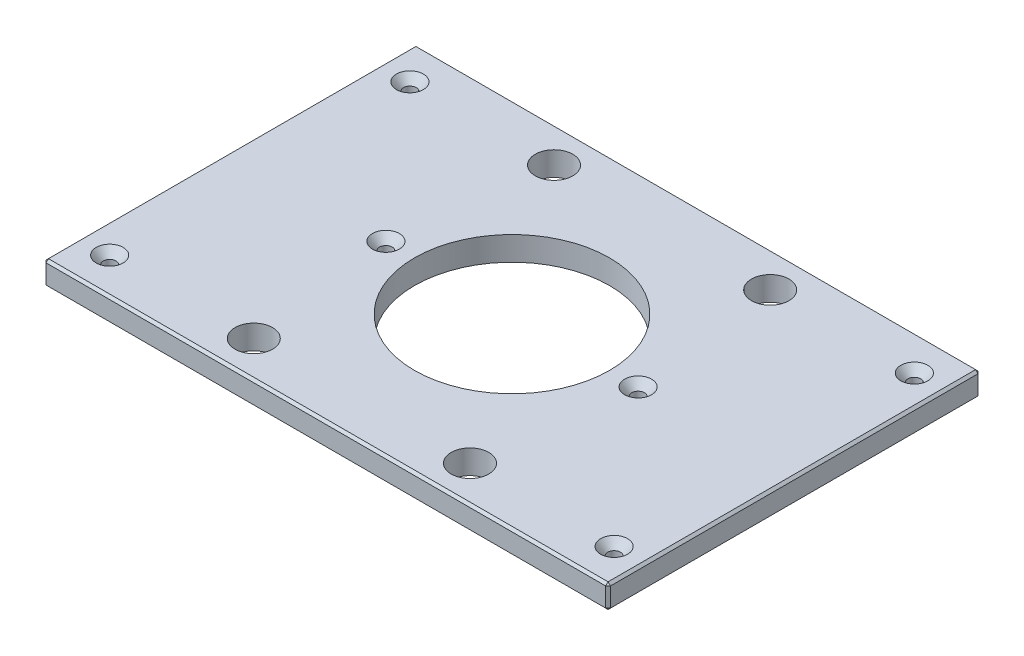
ISO-10303-21;
HEADER;
FILE_DESCRIPTION(('STEP AP214'),'2;1');
FILE_NAME('part.step','',(''),(''),'','','');
FILE_SCHEMA(('AUTOMOTIVE_DESIGN { 1 0 10303 214 1 1 1 1 }'));
ENDSEC;
DATA;
#1=APPLICATION_CONTEXT('core data for automotive mechanical design processes');
#2=APPLICATION_PROTOCOL_DEFINITION('international standard','automotive_design',2000,#1);
#3=PRODUCT_CONTEXT('',#1,'mechanical');
#4=PRODUCT('Part','Part','',(#3));
#5=PRODUCT_RELATED_PRODUCT_CATEGORY('part','',(#4));
#6=PRODUCT_DEFINITION_FORMATION('','',#4);
#7=PRODUCT_DEFINITION_CONTEXT('part definition',#1,'design');
#8=PRODUCT_DEFINITION('design','',#6,#7);
#9=PRODUCT_DEFINITION_SHAPE('','',#8);
#10=(LENGTH_UNIT() NAMED_UNIT(*) SI_UNIT(.MILLI.,.METRE.));
#11=(NAMED_UNIT(*) PLANE_ANGLE_UNIT() SI_UNIT($,.RADIAN.));
#12=(NAMED_UNIT(*) SI_UNIT($,.STERADIAN.) SOLID_ANGLE_UNIT());
#13=UNCERTAINTY_MEASURE_WITH_UNIT(LENGTH_MEASURE(1.E-05),#10,'distance_accuracy_value','');
#14=(GEOMETRIC_REPRESENTATION_CONTEXT(3) GLOBAL_UNCERTAINTY_ASSIGNED_CONTEXT((#13)) GLOBAL_UNIT_ASSIGNED_CONTEXT((#10,
#11,#12)) REPRESENTATION_CONTEXT('',''));
#15=CARTESIAN_POINT('',(0.,0.,0.));
#16=DIRECTION('',(0.,0.,1.));
#17=DIRECTION('',(1.,0.,0.));
#18=AXIS2_PLACEMENT_3D('',#15,#16,#17);
#19=CARTESIAN_POINT('',(-149.225,12.7,-98.425));
#20=DIRECTION('',(1.,0.,0.));
#21=DIRECTION('',(0.,0.,-1.));
#22=AXIS2_PLACEMENT_3D('',#19,#20,#21);
#23=PLANE('',#22);
#24=DIRECTION('',(0.,0.,-1.));
#25=VECTOR('',#24,1.);
#26=CARTESIAN_POINT('',(-149.225,11.4300000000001,-98.425));
#27=LINE('',#26,#25);
#28=CARTESIAN_POINT('',(-149.225,11.4300000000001,97.1550000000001));
#29=VERTEX_POINT('',#28);
#30=CARTESIAN_POINT('',(-149.225,11.4300000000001,-97.1550000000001));
#31=VERTEX_POINT('',#30);
#32=EDGE_CURVE('E134',#29,#31,#27,.T.);
#33=ORIENTED_EDGE('',*,*,#32,.T.);
#34=DIRECTION('',(0.,-1.,0.));
#35=VECTOR('',#34,1.);
#36=CARTESIAN_POINT('',(-149.225,12.7,-97.1550000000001));
#37=LINE('',#36,#35);
#38=CARTESIAN_POINT('',(-149.225,1.26999999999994,-97.1550000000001));
#39=VERTEX_POINT('',#38);
#40=EDGE_CURVE('E130',#31,#39,#37,.T.);
#41=ORIENTED_EDGE('',*,*,#40,.T.);
#42=DIRECTION('',(0.,0.,1.));
#43=VECTOR('',#42,1.);
#44=CARTESIAN_POINT('',(-149.225,1.26999999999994,-98.425));
#45=LINE('',#44,#43);
#46=CARTESIAN_POINT('',(-149.225,1.26999999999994,97.1550000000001));
#47=VERTEX_POINT('',#46);
#48=EDGE_CURVE('E125',#39,#47,#45,.T.);
#49=ORIENTED_EDGE('',*,*,#48,.T.);
#50=DIRECTION('',(0.,1.,0.));
#51=VECTOR('',#50,1.);
#52=CARTESIAN_POINT('',(-149.225,12.7,97.1550000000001));
#53=LINE('',#52,#51);
#54=EDGE_CURVE('E127',#47,#29,#53,.T.);
#55=ORIENTED_EDGE('',*,*,#54,.T.);
#56=EDGE_LOOP('',(#33,#41,#49,#55));
#57=FACE_BOUND('',#56,.T.);
#58=ADVANCED_FACE('F34',(#57),#23,.F.);
#59=CARTESIAN_POINT('',(-149.225,12.7,98.425));
#60=DIRECTION('',(0.,0.,-1.));
#61=DIRECTION('',(-1.,0.,0.));
#62=AXIS2_PLACEMENT_3D('',#59,#60,#61);
#63=PLANE('',#62);
#64=DIRECTION('',(1.,0.,0.));
#65=VECTOR('',#64,1.);
#66=CARTESIAN_POINT('',(-149.225,1.26999999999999,98.425));
#67=LINE('',#66,#65);
#68=CARTESIAN_POINT('',(-147.955,1.26999999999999,98.425));
#69=VERTEX_POINT('',#68);
#70=CARTESIAN_POINT('',(147.955,1.26999999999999,98.425));
#71=VERTEX_POINT('',#70);
#72=EDGE_CURVE('E57',#69,#71,#67,.T.);
#73=ORIENTED_EDGE('',*,*,#72,.T.);
#74=DIRECTION('',(0.,1.,0.));
#75=VECTOR('',#74,1.);
#76=CARTESIAN_POINT('',(147.955,12.7,98.425));
#77=LINE('',#76,#75);
#78=CARTESIAN_POINT('',(147.955,11.43,98.425));
#79=VERTEX_POINT('',#78);
#80=EDGE_CURVE('E11',#71,#79,#77,.T.);
#81=ORIENTED_EDGE('',*,*,#80,.T.);
#82=DIRECTION('',(-1.,0.,0.));
#83=VECTOR('',#82,1.);
#84=CARTESIAN_POINT('',(-149.225,11.43,98.425));
#85=LINE('',#84,#83);
#86=CARTESIAN_POINT('',(-147.955,11.43,98.425));
#87=VERTEX_POINT('',#86);
#88=EDGE_CURVE('E43',#79,#87,#85,.T.);
#89=ORIENTED_EDGE('',*,*,#88,.T.);
#90=DIRECTION('',(0.,-1.,0.));
#91=VECTOR('',#90,1.);
#92=CARTESIAN_POINT('',(-147.955,12.7,98.425));
#93=LINE('',#92,#91);
#94=EDGE_CURVE('E278',#87,#69,#93,.T.);
#95=ORIENTED_EDGE('',*,*,#94,.T.);
#96=EDGE_LOOP('',(#73,#81,#89,#95));
#97=FACE_BOUND('',#96,.T.);
#98=ADVANCED_FACE('F347',(#97),#63,.F.);
#99=CARTESIAN_POINT('',(149.225,12.7,-98.425));
#100=DIRECTION('',(-1.,0.,0.));
#101=DIRECTION('',(0.,0.,1.));
#102=AXIS2_PLACEMENT_3D('',#99,#100,#101);
#103=PLANE('',#102);
#104=DIRECTION('',(0.,0.,-1.));
#105=VECTOR('',#104,1.);
#106=CARTESIAN_POINT('',(149.225,1.26999999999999,-98.425));
#107=LINE('',#106,#105);
#108=CARTESIAN_POINT('',(149.225,1.26999999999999,97.1550000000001));
#109=VERTEX_POINT('',#108);
#110=CARTESIAN_POINT('',(149.225,1.26999999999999,-97.1550000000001));
#111=VERTEX_POINT('',#110);
#112=EDGE_CURVE('E273',#109,#111,#107,.T.);
#113=ORIENTED_EDGE('',*,*,#112,.T.);
#114=DIRECTION('',(0.,1.,0.));
#115=VECTOR('',#114,1.);
#116=CARTESIAN_POINT('',(149.225,12.7,-97.1550000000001));
#117=LINE('',#116,#115);
#118=CARTESIAN_POINT('',(149.225,11.4300000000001,-97.1550000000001));
#119=VERTEX_POINT('',#118);
#120=EDGE_CURVE('E275',#111,#119,#117,.T.);
#121=ORIENTED_EDGE('',*,*,#120,.T.);
#122=DIRECTION('',(0.,0.,1.));
#123=VECTOR('',#122,1.);
#124=CARTESIAN_POINT('',(149.225,11.4300000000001,98.425));
#125=LINE('',#124,#123);
#126=CARTESIAN_POINT('',(149.225,11.4300000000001,97.1550000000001));
#127=VERTEX_POINT('',#126);
#128=EDGE_CURVE('E271',#119,#127,#125,.T.);
#129=ORIENTED_EDGE('',*,*,#128,.T.);
#130=DIRECTION('',(0.,-1.,0.));
#131=VECTOR('',#130,1.);
#132=CARTESIAN_POINT('',(149.225,12.7,97.1550000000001));
#133=LINE('',#132,#131);
#134=EDGE_CURVE('E269',#127,#109,#133,.T.);
#135=ORIENTED_EDGE('',*,*,#134,.T.);
#136=EDGE_LOOP('',(#113,#121,#129,#135));
#137=FACE_BOUND('',#136,.T.);
#138=ADVANCED_FACE('F334',(#137),#103,.F.);
#139=CARTESIAN_POINT('',(-149.225,12.7,-98.425));
#140=DIRECTION('',(0.,0.,1.));
#141=DIRECTION('',(1.,0.,0.));
#142=AXIS2_PLACEMENT_3D('',#139,#140,#141);
#143=PLANE('',#142);
#144=DIRECTION('',(-1.,0.,0.));
#145=VECTOR('',#144,1.);
#146=CARTESIAN_POINT('',(-149.225,1.26999999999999,-98.425));
#147=LINE('',#146,#145);
#148=CARTESIAN_POINT('',(147.955,1.26999999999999,-98.425));
#149=VERTEX_POINT('',#148);
#150=CARTESIAN_POINT('',(-147.955,1.26999999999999,-98.425));
#151=VERTEX_POINT('',#150);
#152=EDGE_CURVE('E245',#149,#151,#147,.T.);
#153=ORIENTED_EDGE('',*,*,#152,.T.);
#154=DIRECTION('',(0.,1.,0.));
#155=VECTOR('',#154,1.);
#156=CARTESIAN_POINT('',(-147.955,12.7,-98.425));
#157=LINE('',#156,#155);
#158=CARTESIAN_POINT('',(-147.955,11.4300000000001,-98.425));
#159=VERTEX_POINT('',#158);
#160=EDGE_CURVE('E249',#151,#159,#157,.T.);
#161=ORIENTED_EDGE('',*,*,#160,.T.);
#162=DIRECTION('',(1.,0.,0.));
#163=VECTOR('',#162,1.);
#164=CARTESIAN_POINT('',(149.225,11.4300000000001,-98.425));
#165=LINE('',#164,#163);
#166=CARTESIAN_POINT('',(147.955,11.4300000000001,-98.425));
#167=VERTEX_POINT('',#166);
#168=EDGE_CURVE('E247',#159,#167,#165,.T.);
#169=ORIENTED_EDGE('',*,*,#168,.T.);
#170=DIRECTION('',(0.,-1.,0.));
#171=VECTOR('',#170,1.);
#172=CARTESIAN_POINT('',(147.955,12.7,-98.425));
#173=LINE('',#172,#171);
#174=EDGE_CURVE('E243',#167,#149,#173,.T.);
#175=ORIENTED_EDGE('',*,*,#174,.T.);
#176=EDGE_LOOP('',(#153,#161,#169,#175));
#177=FACE_BOUND('',#176,.T.);
#178=ADVANCED_FACE('F308',(#177),#143,.F.);
#179=CARTESIAN_POINT('',(0.,12.7,0.));
#180=DIRECTION('',(0.,1.,0.));
#181=DIRECTION('',(0.,0.,1.));
#182=AXIS2_PLACEMENT_3D('',#179,#180,#181);
#183=PLANE('',#182);
#184=CARTESIAN_POINT('',(133.35,12.7,-79.375));
#185=DIRECTION('',(0.,1.,0.));
#186=DIRECTION('',(0.,0.,1.));
#187=AXIS2_PLACEMENT_3D('',#184,#185,#186);
#188=CIRCLE('',#187,7.13739999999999);
#189=CARTESIAN_POINT('',(133.35,12.7,-72.2376));
#190=VERTEX_POINT('',#189);
#191=EDGE_CURVE('E751',#190,#190,#188,.T.);
#192=ORIENTED_EDGE('',*,*,#191,.F.);
#193=EDGE_LOOP('',(#192));
#194=FACE_BOUND('',#193,.T.);
#195=CARTESIAN_POINT('',(133.35,12.7,79.375));
#196=DIRECTION('',(0.,1.,0.));
#197=DIRECTION('',(0.,0.,1.));
#198=AXIS2_PLACEMENT_3D('',#195,#196,#197);
#199=CIRCLE('',#198,7.13739999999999);
#200=CARTESIAN_POINT('',(133.35,12.7,86.5124));
#201=VERTEX_POINT('',#200);
#202=EDGE_CURVE('E755',#201,#201,#199,.T.);
#203=ORIENTED_EDGE('',*,*,#202,.F.);
#204=EDGE_LOOP('',(#203));
#205=FACE_BOUND('',#204,.T.);
#206=CARTESIAN_POINT('',(-133.35,12.7,79.375));
#207=DIRECTION('',(0.,1.,0.));
#208=DIRECTION('',(0.,0.,1.));
#209=AXIS2_PLACEMENT_3D('',#206,#207,#208);
#210=CIRCLE('',#209,7.13739999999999);
#211=CARTESIAN_POINT('',(-133.35,12.7,86.5124));
#212=VERTEX_POINT('',#211);
#213=EDGE_CURVE('E759',#212,#212,#210,.T.);
#214=ORIENTED_EDGE('',*,*,#213,.F.);
#215=EDGE_LOOP('',(#214));
#216=FACE_BOUND('',#215,.T.);
#217=CARTESIAN_POINT('',(-66.675,12.7,0.));
#218=DIRECTION('',(0.,1.,0.));
#219=DIRECTION('',(0.,0.,1.));
#220=AXIS2_PLACEMENT_3D('',#217,#218,#219);
#221=CIRCLE('',#220,7.1374);
#222=CARTESIAN_POINT('',(-66.675,12.7,7.1374));
#223=VERTEX_POINT('',#222);
#224=EDGE_CURVE('E763',#223,#223,#221,.T.);
#225=ORIENTED_EDGE('',*,*,#224,.F.);
#226=EDGE_LOOP('',(#225));
#227=FACE_BOUND('',#226,.T.);
#228=CARTESIAN_POINT('',(66.675,12.7,0.));
#229=DIRECTION('',(0.,1.,0.));
#230=DIRECTION('',(0.,0.,1.));
#231=AXIS2_PLACEMENT_3D('',#228,#229,#230);
#232=CIRCLE('',#231,7.1374);
#233=CARTESIAN_POINT('',(66.675,12.7,7.1374));
#234=VERTEX_POINT('',#233);
#235=EDGE_CURVE('E767',#234,#234,#232,.T.);
#236=ORIENTED_EDGE('',*,*,#235,.F.);
#237=EDGE_LOOP('',(#236));
#238=FACE_BOUND('',#237,.T.);
#239=CARTESIAN_POINT('',(-133.35,12.7,-79.375));
#240=DIRECTION('',(0.,1.,0.));
#241=DIRECTION('',(0.,0.,1.));
#242=AXIS2_PLACEMENT_3D('',#239,#240,#241);
#243=CIRCLE('',#242,7.13739999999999);
#244=CARTESIAN_POINT('',(-133.35,12.7,-72.2376));
#245=VERTEX_POINT('',#244);
#246=EDGE_CURVE('E770',#245,#245,#243,.T.);
#247=ORIENTED_EDGE('',*,*,#246,.F.);
#248=EDGE_LOOP('',(#247));
#249=FACE_BOUND('',#248,.T.);
#250=DIRECTION('',(0.,0.,-1.));
#251=VECTOR('',#250,1.);
#252=CARTESIAN_POINT('',(147.955,12.7,-98.425));
#253=LINE('',#252,#251);
#254=CARTESIAN_POINT('',(147.955,12.7,97.1550000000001));
#255=VERTEX_POINT('',#254);
#256=CARTESIAN_POINT('',(147.955,12.7,-97.155));
#257=VERTEX_POINT('',#256);
#258=EDGE_CURVE('E256',#255,#257,#253,.T.);
#259=ORIENTED_EDGE('',*,*,#258,.T.);
#260=DIRECTION('',(-1.,0.,0.));
#261=VECTOR('',#260,1.);
#262=CARTESIAN_POINT('',(-149.225,12.7,-97.155));
#263=LINE('',#262,#261);
#264=CARTESIAN_POINT('',(-147.955,12.7,-97.155));
#265=VERTEX_POINT('',#264);
#266=EDGE_CURVE('E258',#257,#265,#263,.T.);
#267=ORIENTED_EDGE('',*,*,#266,.T.);
#268=DIRECTION('',(0.,0.,1.));
#269=VECTOR('',#268,1.);
#270=CARTESIAN_POINT('',(-147.955,12.7,98.425));
#271=LINE('',#270,#269);
#272=CARTESIAN_POINT('',(-147.955,12.7,97.1550000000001));
#273=VERTEX_POINT('',#272);
#274=EDGE_CURVE('E254',#265,#273,#271,.T.);
#275=ORIENTED_EDGE('',*,*,#274,.T.);
#276=DIRECTION('',(1.,0.,0.));
#277=VECTOR('',#276,1.);
#278=CARTESIAN_POINT('',(149.225,12.7,97.1550000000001));
#279=LINE('',#278,#277);
#280=EDGE_CURVE('E252',#273,#255,#279,.T.);
#281=ORIENTED_EDGE('',*,*,#280,.T.);
#282=EDGE_LOOP('',(#259,#267,#275,#281));
#283=FACE_BOUND('',#282,.T.);
#284=CARTESIAN_POINT('',(57.15,12.7,-79.375));
#285=DIRECTION('',(0.,1.,0.));
#286=DIRECTION('',(0.,0.,1.));
#287=AXIS2_PLACEMENT_3D('',#284,#285,#286);
#288=CIRCLE('',#287,9.921875);
#289=CARTESIAN_POINT('',(57.15,12.7,-69.453125));
#290=VERTEX_POINT('',#289);
#291=EDGE_CURVE('E203',#290,#290,#288,.T.);
#292=ORIENTED_EDGE('',*,*,#291,.F.);
#293=EDGE_LOOP('',(#292));
#294=FACE_BOUND('',#293,.T.);
#295=CARTESIAN_POINT('',(-57.15,12.7,-79.375));
#296=DIRECTION('',(0.,1.,0.));
#297=DIRECTION('',(0.,0.,1.));
#298=AXIS2_PLACEMENT_3D('',#295,#296,#297);
#299=CIRCLE('',#298,9.921875);
#300=CARTESIAN_POINT('',(-57.15,12.7,-69.453125));
#301=VERTEX_POINT('',#300);
#302=EDGE_CURVE('E213',#301,#301,#299,.T.);
#303=ORIENTED_EDGE('',*,*,#302,.F.);
#304=EDGE_LOOP('',(#303));
#305=FACE_BOUND('',#304,.T.);
#306=CARTESIAN_POINT('',(57.15,12.7,79.375));
#307=DIRECTION('',(0.,1.,0.));
#308=DIRECTION('',(0.,0.,1.));
#309=AXIS2_PLACEMENT_3D('',#306,#307,#308);
#310=CIRCLE('',#309,9.921875);
#311=CARTESIAN_POINT('',(57.15,12.7,89.296875));
#312=VERTEX_POINT('',#311);
#313=EDGE_CURVE('E224',#312,#312,#310,.T.);
#314=ORIENTED_EDGE('',*,*,#313,.F.);
#315=EDGE_LOOP('',(#314));
#316=FACE_BOUND('',#315,.T.);
#317=CARTESIAN_POINT('',(-57.15,12.7,79.375));
#318=DIRECTION('',(0.,1.,0.));
#319=DIRECTION('',(0.,0.,1.));
#320=AXIS2_PLACEMENT_3D('',#317,#318,#319);
#321=CIRCLE('',#320,9.921875);
#322=CARTESIAN_POINT('',(-57.15,12.7,89.296875));
#323=VERTEX_POINT('',#322);
#324=EDGE_CURVE('E230',#323,#323,#321,.T.);
#325=ORIENTED_EDGE('',*,*,#324,.F.);
#326=EDGE_LOOP('',(#325));
#327=FACE_BOUND('',#326,.T.);
#328=CARTESIAN_POINT('',(0.,12.7,0.));
#329=DIRECTION('',(0.,1.,0.));
#330=DIRECTION('',(0.,0.,1.));
#331=AXIS2_PLACEMENT_3D('',#328,#329,#330);
#332=CIRCLE('',#331,51.562);
#333=CARTESIAN_POINT('',(0.,12.7,51.562));
#334=VERTEX_POINT('',#333);
#335=EDGE_CURVE('E236',#334,#334,#332,.T.);
#336=ORIENTED_EDGE('',*,*,#335,.F.);
#337=EDGE_LOOP('',(#336));
#338=FACE_BOUND('',#337,.T.);
#339=ADVANCED_FACE('F356',(#194,#205,#216,#227,#238,#249,#283,#294,#305,#316,#327,#338),#183,.T.);
#340=CARTESIAN_POINT('',(0.,0.,0.));
#341=DIRECTION('',(0.,1.,0.));
#342=DIRECTION('',(0.,0.,1.));
#343=AXIS2_PLACEMENT_3D('',#340,#341,#342);
#344=PLANE('',#343);
#345=CARTESIAN_POINT('',(133.35,0.,-79.375));
#346=DIRECTION('',(0.,1.,0.));
#347=DIRECTION('',(0.,0.,1.));
#348=AXIS2_PLACEMENT_3D('',#345,#346,#347);
#349=CIRCLE('',#348,3.3782);
#350=CARTESIAN_POINT('',(133.35,0.,-75.9968));
#351=VERTEX_POINT('',#350);
#352=EDGE_CURVE('E804',#351,#351,#349,.T.);
#353=ORIENTED_EDGE('',*,*,#352,.T.);
#354=EDGE_LOOP('',(#353));
#355=FACE_BOUND('',#354,.T.);
#356=CARTESIAN_POINT('',(133.35,0.,79.375));
#357=DIRECTION('',(0.,1.,0.));
#358=DIRECTION('',(0.,0.,1.));
#359=AXIS2_PLACEMENT_3D('',#356,#357,#358);
#360=CIRCLE('',#359,3.3782);
#361=CARTESIAN_POINT('',(133.35,0.,82.7532));
#362=VERTEX_POINT('',#361);
#363=EDGE_CURVE('E797',#362,#362,#360,.T.);
#364=ORIENTED_EDGE('',*,*,#363,.T.);
#365=EDGE_LOOP('',(#364));
#366=FACE_BOUND('',#365,.T.);
#367=CARTESIAN_POINT('',(-133.35,0.,79.375));
#368=DIRECTION('',(0.,1.,0.));
#369=DIRECTION('',(0.,0.,1.));
#370=AXIS2_PLACEMENT_3D('',#367,#368,#369);
#371=CIRCLE('',#370,3.3782);
#372=CARTESIAN_POINT('',(-133.35,0.,82.7532));
#373=VERTEX_POINT('',#372);
#374=EDGE_CURVE('E790',#373,#373,#371,.T.);
#375=ORIENTED_EDGE('',*,*,#374,.T.);
#376=EDGE_LOOP('',(#375));
#377=FACE_BOUND('',#376,.T.);
#378=CARTESIAN_POINT('',(-66.675,0.,0.));
#379=DIRECTION('',(0.,1.,0.));
#380=DIRECTION('',(0.,0.,1.));
#381=AXIS2_PLACEMENT_3D('',#378,#379,#380);
#382=CIRCLE('',#381,3.3782);
#383=CARTESIAN_POINT('',(-66.675,0.,3.3782));
#384=VERTEX_POINT('',#383);
#385=EDGE_CURVE('E783',#384,#384,#382,.T.);
#386=ORIENTED_EDGE('',*,*,#385,.T.);
#387=EDGE_LOOP('',(#386));
#388=FACE_BOUND('',#387,.T.);
#389=CARTESIAN_POINT('',(66.675,0.,0.));
#390=DIRECTION('',(0.,1.,0.));
#391=DIRECTION('',(0.,0.,1.));
#392=AXIS2_PLACEMENT_3D('',#389,#390,#391);
#393=CIRCLE('',#392,3.3782);
#394=CARTESIAN_POINT('',(66.675,0.,3.3782));
#395=VERTEX_POINT('',#394);
#396=EDGE_CURVE('E773',#395,#395,#393,.T.);
#397=ORIENTED_EDGE('',*,*,#396,.T.);
#398=EDGE_LOOP('',(#397));
#399=FACE_BOUND('',#398,.T.);
#400=CARTESIAN_POINT('',(-133.35,0.,-79.375));
#401=DIRECTION('',(0.,1.,0.));
#402=DIRECTION('',(0.,0.,1.));
#403=AXIS2_PLACEMENT_3D('',#400,#401,#402);
#404=CIRCLE('',#403,3.3782);
#405=CARTESIAN_POINT('',(-133.35,0.,-75.9968));
#406=VERTEX_POINT('',#405);
#407=EDGE_CURVE('E216',#406,#406,#404,.T.);
#408=ORIENTED_EDGE('',*,*,#407,.T.);
#409=EDGE_LOOP('',(#408));
#410=FACE_BOUND('',#409,.T.);
#411=DIRECTION('',(0.,0.,-1.));
#412=VECTOR('',#411,1.);
#413=CARTESIAN_POINT('',(-147.955,0.,0.));
#414=LINE('',#413,#412);
#415=CARTESIAN_POINT('',(-147.955,0.,97.1550000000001));
#416=VERTEX_POINT('',#415);
#417=CARTESIAN_POINT('',(-147.955,0.,-97.1550000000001));
#418=VERTEX_POINT('',#417);
#419=EDGE_CURVE('E157',#416,#418,#414,.T.);
#420=ORIENTED_EDGE('',*,*,#419,.T.);
#421=DIRECTION('',(1.,0.,0.));
#422=VECTOR('',#421,1.);
#423=CARTESIAN_POINT('',(0.,0.,-97.1550000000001));
#424=LINE('',#423,#422);
#425=CARTESIAN_POINT('',(147.955,0.,-97.1550000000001));
#426=VERTEX_POINT('',#425);
#427=EDGE_CURVE('E266',#418,#426,#424,.T.);
#428=ORIENTED_EDGE('',*,*,#427,.T.);
#429=DIRECTION('',(0.,0.,1.));
#430=VECTOR('',#429,1.);
#431=CARTESIAN_POINT('',(147.955,0.,0.));
#432=LINE('',#431,#430);
#433=CARTESIAN_POINT('',(147.955,0.,97.1550000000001));
#434=VERTEX_POINT('',#433);
#435=EDGE_CURVE('E264',#426,#434,#432,.T.);
#436=ORIENTED_EDGE('',*,*,#435,.T.);
#437=DIRECTION('',(-1.,0.,0.));
#438=VECTOR('',#437,1.);
#439=CARTESIAN_POINT('',(0.,0.,97.1550000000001));
#440=LINE('',#439,#438);
#441=EDGE_CURVE('E261',#434,#416,#440,.T.);
#442=ORIENTED_EDGE('',*,*,#441,.T.);
#443=EDGE_LOOP('',(#420,#428,#436,#442));
#444=FACE_BOUND('',#443,.T.);
#445=CARTESIAN_POINT('',(57.15,0.,-79.375));
#446=DIRECTION('',(0.,1.,0.));
#447=DIRECTION('',(0.,0.,1.));
#448=AXIS2_PLACEMENT_3D('',#445,#446,#447);
#449=CIRCLE('',#448,9.921875);
#450=CARTESIAN_POINT('',(57.15,0.,-69.453125));
#451=VERTEX_POINT('',#450);
#452=EDGE_CURVE('E208',#451,#451,#449,.T.);
#453=ORIENTED_EDGE('',*,*,#452,.T.);
#454=EDGE_LOOP('',(#453));
#455=FACE_BOUND('',#454,.T.);
#456=CARTESIAN_POINT('',(-57.15,0.,-79.375));
#457=DIRECTION('',(0.,1.,0.));
#458=DIRECTION('',(0.,0.,1.));
#459=AXIS2_PLACEMENT_3D('',#456,#457,#458);
#460=CIRCLE('',#459,9.921875);
#461=CARTESIAN_POINT('',(-57.15,0.,-69.453125));
#462=VERTEX_POINT('',#461);
#463=EDGE_CURVE('E221',#462,#462,#460,.T.);
#464=ORIENTED_EDGE('',*,*,#463,.T.);
#465=EDGE_LOOP('',(#464));
#466=FACE_BOUND('',#465,.T.);
#467=CARTESIAN_POINT('',(57.15,0.,79.375));
#468=DIRECTION('',(0.,1.,0.));
#469=DIRECTION('',(0.,0.,1.));
#470=AXIS2_PLACEMENT_3D('',#467,#468,#469);
#471=CIRCLE('',#470,9.921875);
#472=CARTESIAN_POINT('',(57.15,0.,89.296875));
#473=VERTEX_POINT('',#472);
#474=EDGE_CURVE('E227',#473,#473,#471,.T.);
#475=ORIENTED_EDGE('',*,*,#474,.T.);
#476=EDGE_LOOP('',(#475));
#477=FACE_BOUND('',#476,.T.);
#478=CARTESIAN_POINT('',(-57.15,0.,79.375));
#479=DIRECTION('',(0.,1.,0.));
#480=DIRECTION('',(0.,0.,1.));
#481=AXIS2_PLACEMENT_3D('',#478,#479,#480);
#482=CIRCLE('',#481,9.921875);
#483=CARTESIAN_POINT('',(-57.15,0.,89.296875));
#484=VERTEX_POINT('',#483);
#485=EDGE_CURVE('E233',#484,#484,#482,.T.);
#486=ORIENTED_EDGE('',*,*,#485,.T.);
#487=EDGE_LOOP('',(#486));
#488=FACE_BOUND('',#487,.T.);
#489=CARTESIAN_POINT('',(0.,0.,0.));
#490=DIRECTION('',(0.,1.,0.));
#491=DIRECTION('',(0.,0.,1.));
#492=AXIS2_PLACEMENT_3D('',#489,#490,#491);
#493=CIRCLE('',#492,51.562);
#494=CARTESIAN_POINT('',(0.,0.,51.562));
#495=VERTEX_POINT('',#494);
#496=EDGE_CURVE('E146',#495,#495,#493,.T.);
#497=ORIENTED_EDGE('',*,*,#496,.T.);
#498=EDGE_LOOP('',(#497));
#499=FACE_BOUND('',#498,.T.);
#500=ADVANCED_FACE('F321',(#355,#366,#377,#388,#399,#410,#444,#455,#466,#477,#488,#499),#344,.F.);
#501=CARTESIAN_POINT('',(0.,0.,0.));
#502=DIRECTION('',(0.,1.,0.));
#503=DIRECTION('',(0.,0.,1.));
#504=AXIS2_PLACEMENT_3D('',#501,#502,#503);
#505=CYLINDRICAL_SURFACE('',#504,51.562);
#506=ORIENTED_EDGE('',*,*,#496,.F.);
#507=EDGE_LOOP('',(#506));
#508=FACE_BOUND('',#507,.T.);
#509=ORIENTED_EDGE('',*,*,#335,.T.);
#510=EDGE_LOOP('',(#509));
#511=FACE_BOUND('',#510,.T.);
#512=ADVANCED_FACE('F690',(#508,#511),#505,.F.);
#513=CARTESIAN_POINT('',(-57.15,12.7,79.375));
#514=DIRECTION('',(0.,1.,0.));
#515=DIRECTION('',(0.,0.,1.));
#516=AXIS2_PLACEMENT_3D('',#513,#514,#515);
#517=CYLINDRICAL_SURFACE('',#516,9.921875);
#518=ORIENTED_EDGE('',*,*,#485,.F.);
#519=EDGE_LOOP('',(#518));
#520=FACE_BOUND('',#519,.T.);
#521=ORIENTED_EDGE('',*,*,#324,.T.);
#522=EDGE_LOOP('',(#521));
#523=FACE_BOUND('',#522,.T.);
#524=ADVANCED_FACE('F681',(#520,#523),#517,.F.);
#525=CARTESIAN_POINT('',(57.15,12.7,79.375));
#526=DIRECTION('',(0.,1.,0.));
#527=DIRECTION('',(0.,0.,1.));
#528=AXIS2_PLACEMENT_3D('',#525,#526,#527);
#529=CYLINDRICAL_SURFACE('',#528,9.921875);
#530=ORIENTED_EDGE('',*,*,#474,.F.);
#531=EDGE_LOOP('',(#530));
#532=FACE_BOUND('',#531,.T.);
#533=ORIENTED_EDGE('',*,*,#313,.T.);
#534=EDGE_LOOP('',(#533));
#535=FACE_BOUND('',#534,.T.);
#536=ADVANCED_FACE('F672',(#532,#535),#529,.F.);
#537=CARTESIAN_POINT('',(-57.15,12.7,-79.375));
#538=DIRECTION('',(0.,1.,0.));
#539=DIRECTION('',(0.,0.,1.));
#540=AXIS2_PLACEMENT_3D('',#537,#538,#539);
#541=CYLINDRICAL_SURFACE('',#540,9.921875);
#542=ORIENTED_EDGE('',*,*,#463,.F.);
#543=EDGE_LOOP('',(#542));
#544=FACE_BOUND('',#543,.T.);
#545=ORIENTED_EDGE('',*,*,#302,.T.);
#546=EDGE_LOOP('',(#545));
#547=FACE_BOUND('',#546,.T.);
#548=ADVANCED_FACE('F662',(#544,#547),#541,.F.);
#549=CARTESIAN_POINT('',(57.15,12.7,-79.375));
#550=DIRECTION('',(0.,1.,0.));
#551=DIRECTION('',(0.,0.,1.));
#552=AXIS2_PLACEMENT_3D('',#549,#550,#551);
#553=CYLINDRICAL_SURFACE('',#552,9.921875);
#554=ORIENTED_EDGE('',*,*,#452,.F.);
#555=EDGE_LOOP('',(#554));
#556=FACE_BOUND('',#555,.T.);
#557=ORIENTED_EDGE('',*,*,#291,.T.);
#558=EDGE_LOOP('',(#557));
#559=FACE_BOUND('',#558,.T.);
#560=ADVANCED_FACE('F365',(#556,#559),#553,.F.);
#561=CARTESIAN_POINT('',(149.225,12.7,97.1550000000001));
#562=DIRECTION('',(-0.707106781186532,0.,-0.707106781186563));
#563=DIRECTION('',(0.,-1.,0.));
#564=AXIS2_PLACEMENT_3D('',#561,#562,#563);
#565=PLANE('',#564);
#566=DIRECTION('',(-0.707106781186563,0.,0.707106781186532));
#567=VECTOR('',#566,1.);
#568=CARTESIAN_POINT('',(149.225,11.4300000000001,97.1550000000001));
#569=LINE('',#568,#567);
#570=EDGE_CURVE('E38',#79,#127,#569,.F.);
#571=ORIENTED_EDGE('',*,*,#570,.F.);
#572=ORIENTED_EDGE('',*,*,#80,.F.);
#573=DIRECTION('',(0.707106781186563,0.,-0.707106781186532));
#574=VECTOR('',#573,1.);
#575=CARTESIAN_POINT('',(148.59,1.26999999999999,97.79));
#576=LINE('',#575,#574);
#577=EDGE_CURVE('E196',#109,#71,#576,.F.);
#578=ORIENTED_EDGE('',*,*,#577,.F.);
#579=ORIENTED_EDGE('',*,*,#134,.F.);
#580=EDGE_LOOP('',(#571,#572,#578,#579));
#581=FACE_BOUND('',#580,.T.);
#582=ADVANCED_FACE('F36',(#581),#565,.F.);
#583=CARTESIAN_POINT('',(149.225,11.4300000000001,97.1550000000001));
#584=DIRECTION('',(0.577350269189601,0.577350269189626,0.577350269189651));
#585=DIRECTION('',(0.,-0.707106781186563,0.707106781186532));
#586=AXIS2_PLACEMENT_3D('',#583,#584,#585);
#587=PLANE('',#586);
#588=DIRECTION('',(0.,-0.707106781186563,0.707106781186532));
#589=VECTOR('',#588,1.);
#590=CARTESIAN_POINT('',(147.955,12.065,97.79));
#591=LINE('',#590,#589);
#592=EDGE_CURVE('E192',#79,#255,#591,.F.);
#593=ORIENTED_EDGE('',*,*,#592,.F.);
#594=ORIENTED_EDGE('',*,*,#570,.T.);
#595=DIRECTION('',(-0.707106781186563,0.707106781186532,0.));
#596=VECTOR('',#595,1.);
#597=CARTESIAN_POINT('',(149.225,11.4300000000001,97.1550000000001));
#598=LINE('',#597,#596);
#599=EDGE_CURVE('E194',#255,#127,#598,.F.);
#600=ORIENTED_EDGE('',*,*,#599,.F.);
#601=EDGE_LOOP('',(#593,#594,#600));
#602=FACE_BOUND('',#601,.T.);
#603=ADVANCED_FACE('F358',(#602),#587,.T.);
#604=CARTESIAN_POINT('',(147.955,0.,97.1550000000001));
#605=DIRECTION('',(0.577350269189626,-0.577350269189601,0.577350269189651));
#606=DIRECTION('',(0.707106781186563,0.,-0.707106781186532));
#607=AXIS2_PLACEMENT_3D('',#604,#605,#606);
#608=PLANE('',#607);
#609=DIRECTION('',(-0.707106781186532,-0.707106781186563,0.));
#610=VECTOR('',#609,1.);
#611=CARTESIAN_POINT('',(147.955,0.,97.1550000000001));
#612=LINE('',#611,#610);
#613=EDGE_CURVE('E186',#109,#434,#612,.T.);
#614=ORIENTED_EDGE('',*,*,#613,.F.);
#615=ORIENTED_EDGE('',*,*,#577,.T.);
#616=DIRECTION('',(0.,0.707106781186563,0.707106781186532));
#617=VECTOR('',#616,1.);
#618=CARTESIAN_POINT('',(147.955,0.,97.1550000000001));
#619=LINE('',#618,#617);
#620=EDGE_CURVE('E189',#434,#71,#619,.T.);
#621=ORIENTED_EDGE('',*,*,#620,.F.);
#622=EDGE_LOOP('',(#614,#615,#621));
#623=FACE_BOUND('',#622,.T.);
#624=ADVANCED_FACE('F327',(#623),#608,.T.);
#625=CARTESIAN_POINT('',(147.955,12.7,0.));
#626=DIRECTION('',(0.707106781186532,0.707106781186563,0.));
#627=DIRECTION('',(0.,0.,1.));
#628=AXIS2_PLACEMENT_3D('',#625,#626,#627);
#629=PLANE('',#628);
#630=ORIENTED_EDGE('',*,*,#599,.T.);
#631=ORIENTED_EDGE('',*,*,#128,.F.);
#632=DIRECTION('',(0.707106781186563,-0.707106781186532,0.));
#633=VECTOR('',#632,1.);
#634=CARTESIAN_POINT('',(148.59,12.065,-97.155));
#635=LINE('',#634,#633);
#636=EDGE_CURVE('E181',#257,#119,#635,.T.);
#637=ORIENTED_EDGE('',*,*,#636,.F.);
#638=ORIENTED_EDGE('',*,*,#258,.F.);
#639=EDGE_LOOP('',(#630,#631,#637,#638));
#640=FACE_BOUND('',#639,.T.);
#641=ADVANCED_FACE('F344',(#640),#629,.T.);
#642=CARTESIAN_POINT('',(0.,12.7,97.1550000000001));
#643=DIRECTION('',(0.,0.707106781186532,0.707106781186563));
#644=DIRECTION('',(-1.,0.,0.));
#645=AXIS2_PLACEMENT_3D('',#642,#643,#644);
#646=PLANE('',#645);
#647=ORIENTED_EDGE('',*,*,#592,.T.);
#648=ORIENTED_EDGE('',*,*,#280,.F.);
#649=DIRECTION('',(0.,0.707106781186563,-0.707106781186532));
#650=VECTOR('',#649,1.);
#651=CARTESIAN_POINT('',(-147.955,12.7,97.1550000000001));
#652=LINE('',#651,#650);
#653=EDGE_CURVE('E178',#87,#273,#652,.T.);
#654=ORIENTED_EDGE('',*,*,#653,.F.);
#655=ORIENTED_EDGE('',*,*,#88,.F.);
#656=EDGE_LOOP('',(#647,#648,#654,#655));
#657=FACE_BOUND('',#656,.T.);
#658=ADVANCED_FACE('F349',(#657),#646,.T.);
#659=CARTESIAN_POINT('',(-147.955,12.7,98.425));
#660=DIRECTION('',(0.707106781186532,0.,-0.707106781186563));
#661=DIRECTION('',(0.,-1.,0.));
#662=AXIS2_PLACEMENT_3D('',#659,#660,#661);
#663=PLANE('',#662);
#664=DIRECTION('',(0.707106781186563,0.,0.707106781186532));
#665=VECTOR('',#664,1.);
#666=CARTESIAN_POINT('',(-149.225,1.26999999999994,97.1550000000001));
#667=LINE('',#666,#665);
#668=EDGE_CURVE('E141',#69,#47,#667,.F.);
#669=ORIENTED_EDGE('',*,*,#668,.F.);
#670=ORIENTED_EDGE('',*,*,#94,.F.);
#671=DIRECTION('',(-0.707106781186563,0.,-0.707106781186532));
#672=VECTOR('',#671,1.);
#673=CARTESIAN_POINT('',(-148.59,11.43,97.79));
#674=LINE('',#673,#672);
#675=EDGE_CURVE('E144',#29,#87,#674,.F.);
#676=ORIENTED_EDGE('',*,*,#675,.F.);
#677=ORIENTED_EDGE('',*,*,#54,.F.);
#678=EDGE_LOOP('',(#669,#670,#676,#677));
#679=FACE_BOUND('',#678,.T.);
#680=ADVANCED_FACE('F139',(#679),#663,.F.);
#681=CARTESIAN_POINT('',(-149.225,1.26999999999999,98.425));
#682=DIRECTION('',(0.,0.707106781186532,-0.707106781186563));
#683=DIRECTION('',(1.,0.,0.));
#684=AXIS2_PLACEMENT_3D('',#681,#682,#683);
#685=PLANE('',#684);
#686=ORIENTED_EDGE('',*,*,#620,.T.);
#687=ORIENTED_EDGE('',*,*,#72,.F.);
#688=DIRECTION('',(0.,-0.707106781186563,-0.707106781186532));
#689=VECTOR('',#688,1.);
#690=CARTESIAN_POINT('',(-147.955,0.634999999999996,97.79));
#691=LINE('',#690,#689);
#692=EDGE_CURVE('E154',#416,#69,#691,.F.);
#693=ORIENTED_EDGE('',*,*,#692,.F.);
#694=ORIENTED_EDGE('',*,*,#441,.F.);
#695=EDGE_LOOP('',(#686,#687,#693,#694));
#696=FACE_BOUND('',#695,.T.);
#697=ADVANCED_FACE('F326',(#696),#685,.F.);
#698=CARTESIAN_POINT('',(149.225,1.26999999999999,-98.425));
#699=DIRECTION('',(-0.707106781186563,0.707106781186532,0.));
#700=DIRECTION('',(0.,0.,-1.));
#701=AXIS2_PLACEMENT_3D('',#698,#699,#700);
#702=PLANE('',#701);
#703=ORIENTED_EDGE('',*,*,#613,.T.);
#704=ORIENTED_EDGE('',*,*,#435,.F.);
#705=DIRECTION('',(0.707106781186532,0.707106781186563,0.));
#706=VECTOR('',#705,1.);
#707=CARTESIAN_POINT('',(147.955,0.,-97.1550000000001));
#708=LINE('',#707,#706);
#709=EDGE_CURVE('E173',#111,#426,#708,.F.);
#710=ORIENTED_EDGE('',*,*,#709,.F.);
#711=ORIENTED_EDGE('',*,*,#112,.F.);
#712=EDGE_LOOP('',(#703,#704,#710,#711));
#713=FACE_BOUND('',#712,.T.);
#714=ADVANCED_FACE('F331',(#713),#702,.F.);
#715=CARTESIAN_POINT('',(147.955,12.7,-98.425));
#716=DIRECTION('',(-0.707106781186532,0.,0.707106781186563));
#717=DIRECTION('',(0.,-1.,0.));
#718=AXIS2_PLACEMENT_3D('',#715,#716,#717);
#719=PLANE('',#718);
#720=DIRECTION('',(0.707106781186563,0.,0.707106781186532));
#721=VECTOR('',#720,1.);
#722=CARTESIAN_POINT('',(147.955,11.4300000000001,-98.425));
#723=LINE('',#722,#721);
#724=EDGE_CURVE('E183',#119,#167,#723,.F.);
#725=ORIENTED_EDGE('',*,*,#724,.F.);
#726=ORIENTED_EDGE('',*,*,#120,.F.);
#727=DIRECTION('',(-0.707106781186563,0.,-0.707106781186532));
#728=VECTOR('',#727,1.);
#729=CARTESIAN_POINT('',(148.59,1.26999999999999,-97.79));
#730=LINE('',#729,#728);
#731=EDGE_CURVE('E170',#149,#111,#730,.F.);
#732=ORIENTED_EDGE('',*,*,#731,.F.);
#733=ORIENTED_EDGE('',*,*,#174,.F.);
#734=EDGE_LOOP('',(#725,#726,#732,#733));
#735=FACE_BOUND('',#734,.T.);
#736=ADVANCED_FACE('F339',(#735),#719,.F.);
#737=CARTESIAN_POINT('',(147.955,11.4300000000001,-98.425));
#738=DIRECTION('',(0.577350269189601,0.577350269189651,-0.577350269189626));
#739=DIRECTION('',(0.,0.707106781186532,0.707106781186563));
#740=AXIS2_PLACEMENT_3D('',#737,#738,#739);
#741=PLANE('',#740);
#742=ORIENTED_EDGE('',*,*,#636,.T.);
#743=ORIENTED_EDGE('',*,*,#724,.T.);
#744=DIRECTION('',(0.,0.707106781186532,0.707106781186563));
#745=VECTOR('',#744,1.);
#746=CARTESIAN_POINT('',(147.955,11.4300000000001,-98.425));
#747=LINE('',#746,#745);
#748=EDGE_CURVE('E162',#257,#167,#747,.F.);
#749=ORIENTED_EDGE('',*,*,#748,.F.);
#750=EDGE_LOOP('',(#742,#743,#749));
#751=FACE_BOUND('',#750,.T.);
#752=ADVANCED_FACE('F397',(#751),#741,.T.);
#753=CARTESIAN_POINT('',(-147.955,12.7,97.1550000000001));
#754=DIRECTION('',(-0.577350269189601,0.577350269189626,0.577350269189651));
#755=DIRECTION('',(0.,-0.707106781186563,0.707106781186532));
#756=AXIS2_PLACEMENT_3D('',#753,#754,#755);
#757=PLANE('',#756);
#758=ORIENTED_EDGE('',*,*,#675,.T.);
#759=ORIENTED_EDGE('',*,*,#653,.T.);
#760=DIRECTION('',(-0.707106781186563,-0.707106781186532,0.));
#761=VECTOR('',#760,1.);
#762=CARTESIAN_POINT('',(-147.955,12.7,97.1550000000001));
#763=LINE('',#762,#761);
#764=EDGE_CURVE('E158',#29,#273,#763,.F.);
#765=ORIENTED_EDGE('',*,*,#764,.F.);
#766=EDGE_LOOP('',(#758,#759,#765));
#767=FACE_BOUND('',#766,.T.);
#768=ADVANCED_FACE('F351',(#767),#757,.T.);
#769=CARTESIAN_POINT('',(-149.225,1.26999999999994,97.1550000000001));
#770=DIRECTION('',(-0.577350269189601,-0.577350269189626,0.577350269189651));
#771=DIRECTION('',(0.,-0.707106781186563,-0.707106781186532));
#772=AXIS2_PLACEMENT_3D('',#769,#770,#771);
#773=PLANE('',#772);
#774=ORIENTED_EDGE('',*,*,#692,.T.);
#775=ORIENTED_EDGE('',*,*,#668,.T.);
#776=DIRECTION('',(-0.707106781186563,0.707106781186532,0.));
#777=VECTOR('',#776,1.);
#778=CARTESIAN_POINT('',(-149.225,1.26999999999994,97.1550000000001));
#779=LINE('',#778,#777);
#780=EDGE_CURVE('E151',#416,#47,#779,.T.);
#781=ORIENTED_EDGE('',*,*,#780,.F.);
#782=EDGE_LOOP('',(#774,#775,#781));
#783=FACE_BOUND('',#782,.T.);
#784=ADVANCED_FACE('F150',(#783),#773,.T.);
#785=CARTESIAN_POINT('',(147.955,0.,-97.1550000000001));
#786=DIRECTION('',(0.577350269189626,-0.577350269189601,-0.577350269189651));
#787=DIRECTION('',(-0.707106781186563,0.,-0.707106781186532));
#788=AXIS2_PLACEMENT_3D('',#785,#786,#787);
#789=PLANE('',#788);
#790=ORIENTED_EDGE('',*,*,#731,.T.);
#791=ORIENTED_EDGE('',*,*,#709,.T.);
#792=DIRECTION('',(0.,-0.707106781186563,0.707106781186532));
#793=VECTOR('',#792,1.);
#794=CARTESIAN_POINT('',(147.955,0.,-97.1550000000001));
#795=LINE('',#794,#793);
#796=EDGE_CURVE('E159',#149,#426,#795,.T.);
#797=ORIENTED_EDGE('',*,*,#796,.F.);
#798=EDGE_LOOP('',(#790,#791,#797));
#799=FACE_BOUND('',#798,.T.);
#800=ADVANCED_FACE('F389',(#799),#789,.T.);
#801=CARTESIAN_POINT('',(0.,12.7,-97.155));
#802=DIRECTION('',(0.,0.707106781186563,-0.707106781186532));
#803=DIRECTION('',(1.,0.,0.));
#804=AXIS2_PLACEMENT_3D('',#801,#802,#803);
#805=PLANE('',#804);
#806=ORIENTED_EDGE('',*,*,#748,.T.);
#807=ORIENTED_EDGE('',*,*,#168,.F.);
#808=DIRECTION('',(0.,-0.707106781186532,-0.707106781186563));
#809=VECTOR('',#808,1.);
#810=CARTESIAN_POINT('',(-147.955,11.4300000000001,-98.425));
#811=LINE('',#810,#809);
#812=EDGE_CURVE('E164',#265,#159,#811,.T.);
#813=ORIENTED_EDGE('',*,*,#812,.F.);
#814=ORIENTED_EDGE('',*,*,#266,.F.);
#815=EDGE_LOOP('',(#806,#807,#813,#814));
#816=FACE_BOUND('',#815,.T.);
#817=ADVANCED_FACE('F303',(#816),#805,.T.);
#818=CARTESIAN_POINT('',(-147.955,12.7,0.));
#819=DIRECTION('',(-0.707106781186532,0.707106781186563,0.));
#820=DIRECTION('',(0.,0.,-1.));
#821=AXIS2_PLACEMENT_3D('',#818,#819,#820);
#822=PLANE('',#821);
#823=ORIENTED_EDGE('',*,*,#764,.T.);
#824=ORIENTED_EDGE('',*,*,#274,.F.);
#825=DIRECTION('',(0.707106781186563,0.707106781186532,0.));
#826=VECTOR('',#825,1.);
#827=CARTESIAN_POINT('',(-148.59,12.065,-97.155));
#828=LINE('',#827,#826);
#829=EDGE_CURVE('E292',#31,#265,#828,.T.);
#830=ORIENTED_EDGE('',*,*,#829,.F.);
#831=ORIENTED_EDGE('',*,*,#32,.F.);
#832=EDGE_LOOP('',(#823,#824,#830,#831));
#833=FACE_BOUND('',#832,.T.);
#834=ADVANCED_FACE('F354',(#833),#822,.T.);
#835=CARTESIAN_POINT('',(-149.225,1.26999999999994,-98.425));
#836=DIRECTION('',(0.707106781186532,0.707106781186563,0.));
#837=DIRECTION('',(0.,0.,1.));
#838=AXIS2_PLACEMENT_3D('',#835,#836,#837);
#839=PLANE('',#838);
#840=ORIENTED_EDGE('',*,*,#780,.T.);
#841=ORIENTED_EDGE('',*,*,#48,.F.);
#842=DIRECTION('',(0.707106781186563,-0.707106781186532,0.));
#843=VECTOR('',#842,1.);
#844=CARTESIAN_POINT('',(-149.225,1.26999999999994,-97.1550000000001));
#845=LINE('',#844,#843);
#846=EDGE_CURVE('E289',#418,#39,#845,.F.);
#847=ORIENTED_EDGE('',*,*,#846,.F.);
#848=ORIENTED_EDGE('',*,*,#419,.F.);
#849=EDGE_LOOP('',(#840,#841,#847,#848));
#850=FACE_BOUND('',#849,.T.);
#851=ADVANCED_FACE('F156',(#850),#839,.F.);
#852=CARTESIAN_POINT('',(-149.225,1.26999999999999,-98.425));
#853=DIRECTION('',(0.,0.707106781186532,0.707106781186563));
#854=DIRECTION('',(-1.,0.,0.));
#855=AXIS2_PLACEMENT_3D('',#852,#853,#854);
#856=PLANE('',#855);
#857=ORIENTED_EDGE('',*,*,#796,.T.);
#858=ORIENTED_EDGE('',*,*,#427,.F.);
#859=DIRECTION('',(0.,0.707106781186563,-0.707106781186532));
#860=VECTOR('',#859,1.);
#861=CARTESIAN_POINT('',(-147.955,0.634999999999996,-97.79));
#862=LINE('',#861,#860);
#863=EDGE_CURVE('E286',#151,#418,#862,.F.);
#864=ORIENTED_EDGE('',*,*,#863,.F.);
#865=ORIENTED_EDGE('',*,*,#152,.F.);
#866=EDGE_LOOP('',(#857,#858,#864,#865));
#867=FACE_BOUND('',#866,.T.);
#868=ADVANCED_FACE('F318',(#867),#856,.F.);
#869=CARTESIAN_POINT('',(-147.955,11.4300000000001,-98.425));
#870=DIRECTION('',(-0.577350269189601,0.577350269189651,-0.577350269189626));
#871=DIRECTION('',(0.,0.707106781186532,0.707106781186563));
#872=AXIS2_PLACEMENT_3D('',#869,#870,#871);
#873=PLANE('',#872);
#874=ORIENTED_EDGE('',*,*,#829,.T.);
#875=ORIENTED_EDGE('',*,*,#812,.T.);
#876=DIRECTION('',(0.707106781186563,0.,-0.707106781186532));
#877=VECTOR('',#876,1.);
#878=CARTESIAN_POINT('',(-147.955,11.4300000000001,-98.425));
#879=LINE('',#878,#877);
#880=EDGE_CURVE('E284',#31,#159,#879,.T.);
#881=ORIENTED_EDGE('',*,*,#880,.F.);
#882=EDGE_LOOP('',(#874,#875,#881));
#883=FACE_BOUND('',#882,.T.);
#884=ADVANCED_FACE('F298',(#883),#873,.T.);
#885=CARTESIAN_POINT('',(-149.225,1.26999999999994,-97.1550000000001));
#886=DIRECTION('',(-0.577350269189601,-0.577350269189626,-0.577350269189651));
#887=DIRECTION('',(0.,0.707106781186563,-0.707106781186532));
#888=AXIS2_PLACEMENT_3D('',#885,#886,#887);
#889=PLANE('',#888);
#890=ORIENTED_EDGE('',*,*,#863,.T.);
#891=ORIENTED_EDGE('',*,*,#846,.T.);
#892=DIRECTION('',(-0.707106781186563,0.,0.707106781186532));
#893=VECTOR('',#892,1.);
#894=CARTESIAN_POINT('',(-149.225,1.26999999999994,-97.1550000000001));
#895=LINE('',#894,#893);
#896=EDGE_CURVE('E282',#151,#39,#895,.T.);
#897=ORIENTED_EDGE('',*,*,#896,.F.);
#898=EDGE_LOOP('',(#890,#891,#897));
#899=FACE_BOUND('',#898,.T.);
#900=ADVANCED_FACE('F315',(#899),#889,.T.);
#901=CARTESIAN_POINT('',(-149.225,12.7,-97.1550000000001));
#902=DIRECTION('',(0.707106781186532,0.,0.707106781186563));
#903=DIRECTION('',(0.,-1.,0.));
#904=AXIS2_PLACEMENT_3D('',#901,#902,#903);
#905=PLANE('',#904);
#906=ORIENTED_EDGE('',*,*,#880,.T.);
#907=ORIENTED_EDGE('',*,*,#160,.F.);
#908=ORIENTED_EDGE('',*,*,#896,.T.);
#909=ORIENTED_EDGE('',*,*,#40,.F.);
#910=EDGE_LOOP('',(#906,#907,#908,#909));
#911=FACE_BOUND('',#910,.T.);
#912=ADVANCED_FACE('F313',(#911),#905,.F.);
#913=CARTESIAN_POINT('',(-133.35,12.7,-79.375));
#914=DIRECTION('',(0.,1.,0.));
#915=DIRECTION('',(0.,0.,1.));
#916=AXIS2_PLACEMENT_3D('',#913,#914,#915);
#917=CYLINDRICAL_SURFACE('',#916,3.3782);
#918=ORIENTED_EDGE('',*,*,#407,.F.);
#919=EDGE_LOOP('',(#918));
#920=FACE_BOUND('',#919,.T.);
#921=CARTESIAN_POINT('',(-133.35,8.37553508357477,-79.375));
#922=DIRECTION('',(0.,1.,0.));
#923=DIRECTION('',(0.,0.,1.));
#924=AXIS2_PLACEMENT_3D('',#921,#922,#923);
#925=CIRCLE('',#924,3.3782);
#926=CARTESIAN_POINT('',(-133.35,8.37553508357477,-75.9968));
#927=VERTEX_POINT('',#926);
#928=EDGE_CURVE('E772',#927,#927,#925,.T.);
#929=ORIENTED_EDGE('',*,*,#928,.T.);
#930=EDGE_LOOP('',(#929));
#931=FACE_BOUND('',#930,.T.);
#932=ADVANCED_FACE('F376',(#920,#931),#917,.F.);
#933=CARTESIAN_POINT('',(-133.35,12.7,-79.375));
#934=DIRECTION('',(0.,1.,0.));
#935=DIRECTION('',(0.,0.,1.));
#936=AXIS2_PLACEMENT_3D('',#933,#934,#935);
#937=CONICAL_SURFACE('',#936,7.13739999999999,0.715584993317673);
#938=ORIENTED_EDGE('',*,*,#928,.F.);
#939=EDGE_LOOP('',(#938));
#940=FACE_BOUND('',#939,.T.);
#941=ORIENTED_EDGE('',*,*,#246,.T.);
#942=EDGE_LOOP('',(#941));
#943=FACE_BOUND('',#942,.T.);
#944=ADVANCED_FACE('F486',(#940,#943),#937,.F.);
#945=CARTESIAN_POINT('',(66.675,12.7,0.));
#946=DIRECTION('',(0.,1.,0.));
#947=DIRECTION('',(0.,0.,1.));
#948=AXIS2_PLACEMENT_3D('',#945,#946,#947);
#949=CYLINDRICAL_SURFACE('',#948,3.3782);
#950=ORIENTED_EDGE('',*,*,#396,.F.);
#951=EDGE_LOOP('',(#950));
#952=FACE_BOUND('',#951,.T.);
#953=CARTESIAN_POINT('',(66.675,8.37553508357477,0.));
#954=DIRECTION('',(0.,1.,0.));
#955=DIRECTION('',(0.,0.,1.));
#956=AXIS2_PLACEMENT_3D('',#953,#954,#955);
#957=CIRCLE('',#956,3.3782);
#958=CARTESIAN_POINT('',(66.675,8.37553508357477,3.3782));
#959=VERTEX_POINT('',#958);
#960=EDGE_CURVE('E777',#959,#959,#957,.T.);
#961=ORIENTED_EDGE('',*,*,#960,.T.);
#962=EDGE_LOOP('',(#961));
#963=FACE_BOUND('',#962,.T.);
#964=ADVANCED_FACE('F495',(#952,#963),#949,.F.);
#965=CARTESIAN_POINT('',(66.675,12.7,0.));
#966=DIRECTION('',(0.,1.,0.));
#967=DIRECTION('',(0.,0.,1.));
#968=AXIS2_PLACEMENT_3D('',#965,#966,#967);
#969=CONICAL_SURFACE('',#968,7.1374,0.715584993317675);
#970=ORIENTED_EDGE('',*,*,#960,.F.);
#971=EDGE_LOOP('',(#970));
#972=FACE_BOUND('',#971,.T.);
#973=ORIENTED_EDGE('',*,*,#235,.T.);
#974=EDGE_LOOP('',(#973));
#975=FACE_BOUND('',#974,.T.);
#976=ADVANCED_FACE('F503',(#972,#975),#969,.F.);
#977=CARTESIAN_POINT('',(-66.675,12.7,0.));
#978=DIRECTION('',(0.,1.,0.));
#979=DIRECTION('',(0.,0.,1.));
#980=AXIS2_PLACEMENT_3D('',#977,#978,#979);
#981=CYLINDRICAL_SURFACE('',#980,3.3782);
#982=ORIENTED_EDGE('',*,*,#385,.F.);
#983=EDGE_LOOP('',(#982));
#984=FACE_BOUND('',#983,.T.);
#985=CARTESIAN_POINT('',(-66.675,8.37553508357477,0.));
#986=DIRECTION('',(0.,1.,0.));
#987=DIRECTION('',(0.,0.,1.));
#988=AXIS2_PLACEMENT_3D('',#985,#986,#987);
#989=CIRCLE('',#988,3.3782);
#990=CARTESIAN_POINT('',(-66.675,8.37553508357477,3.3782));
#991=VERTEX_POINT('',#990);
#992=EDGE_CURVE('E786',#991,#991,#989,.T.);
#993=ORIENTED_EDGE('',*,*,#992,.T.);
#994=EDGE_LOOP('',(#993));
#995=FACE_BOUND('',#994,.T.);
#996=ADVANCED_FACE('F511',(#984,#995),#981,.F.);
#997=CARTESIAN_POINT('',(-66.675,12.7,0.));
#998=DIRECTION('',(0.,1.,0.));
#999=DIRECTION('',(0.,0.,1.));
#1000=AXIS2_PLACEMENT_3D('',#997,#998,#999);
#1001=CONICAL_SURFACE('',#1000,7.1374,0.715584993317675);
#1002=ORIENTED_EDGE('',*,*,#992,.F.);
#1003=EDGE_LOOP('',(#1002));
#1004=FACE_BOUND('',#1003,.T.);
#1005=ORIENTED_EDGE('',*,*,#224,.T.);
#1006=EDGE_LOOP('',(#1005));
#1007=FACE_BOUND('',#1006,.T.);
#1008=ADVANCED_FACE('F519',(#1004,#1007),#1001,.F.);
#1009=CARTESIAN_POINT('',(-133.35,12.7,79.375));
#1010=DIRECTION('',(0.,1.,0.));
#1011=DIRECTION('',(0.,0.,1.));
#1012=AXIS2_PLACEMENT_3D('',#1009,#1010,#1011);
#1013=CYLINDRICAL_SURFACE('',#1012,3.3782);
#1014=ORIENTED_EDGE('',*,*,#374,.F.);
#1015=EDGE_LOOP('',(#1014));
#1016=FACE_BOUND('',#1015,.T.);
#1017=CARTESIAN_POINT('',(-133.35,8.37553508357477,79.375));
#1018=DIRECTION('',(0.,1.,0.));
#1019=DIRECTION('',(0.,0.,1.));
#1020=AXIS2_PLACEMENT_3D('',#1017,#1018,#1019);
#1021=CIRCLE('',#1020,3.3782);
#1022=CARTESIAN_POINT('',(-133.35,8.37553508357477,82.7532));
#1023=VERTEX_POINT('',#1022);
#1024=EDGE_CURVE('E793',#1023,#1023,#1021,.T.);
#1025=ORIENTED_EDGE('',*,*,#1024,.T.);
#1026=EDGE_LOOP('',(#1025));
#1027=FACE_BOUND('',#1026,.T.);
#1028=ADVANCED_FACE('F527',(#1016,#1027),#1013,.F.);
#1029=CARTESIAN_POINT('',(-133.35,12.7,79.375));
#1030=DIRECTION('',(0.,1.,0.));
#1031=DIRECTION('',(0.,0.,1.));
#1032=AXIS2_PLACEMENT_3D('',#1029,#1030,#1031);
#1033=CONICAL_SURFACE('',#1032,7.13739999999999,0.715584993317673);
#1034=ORIENTED_EDGE('',*,*,#1024,.F.);
#1035=EDGE_LOOP('',(#1034));
#1036=FACE_BOUND('',#1035,.T.);
#1037=ORIENTED_EDGE('',*,*,#213,.T.);
#1038=EDGE_LOOP('',(#1037));
#1039=FACE_BOUND('',#1038,.T.);
#1040=ADVANCED_FACE('F535',(#1036,#1039),#1033,.F.);
#1041=CARTESIAN_POINT('',(133.35,12.7,79.375));
#1042=DIRECTION('',(0.,1.,0.));
#1043=DIRECTION('',(0.,0.,1.));
#1044=AXIS2_PLACEMENT_3D('',#1041,#1042,#1043);
#1045=CYLINDRICAL_SURFACE('',#1044,3.3782);
#1046=ORIENTED_EDGE('',*,*,#363,.F.);
#1047=EDGE_LOOP('',(#1046));
#1048=FACE_BOUND('',#1047,.T.);
#1049=CARTESIAN_POINT('',(133.35,8.37553508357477,79.375));
#1050=DIRECTION('',(0.,1.,0.));
#1051=DIRECTION('',(0.,0.,1.));
#1052=AXIS2_PLACEMENT_3D('',#1049,#1050,#1051);
#1053=CIRCLE('',#1052,3.3782);
#1054=CARTESIAN_POINT('',(133.35,8.37553508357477,82.7532));
#1055=VERTEX_POINT('',#1054);
#1056=EDGE_CURVE('E800',#1055,#1055,#1053,.T.);
#1057=ORIENTED_EDGE('',*,*,#1056,.T.);
#1058=EDGE_LOOP('',(#1057));
#1059=FACE_BOUND('',#1058,.T.);
#1060=ADVANCED_FACE('F543',(#1048,#1059),#1045,.F.);
#1061=CARTESIAN_POINT('',(133.35,12.7,79.375));
#1062=DIRECTION('',(0.,1.,0.));
#1063=DIRECTION('',(0.,0.,1.));
#1064=AXIS2_PLACEMENT_3D('',#1061,#1062,#1063);
#1065=CONICAL_SURFACE('',#1064,7.13739999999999,0.715584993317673);
#1066=ORIENTED_EDGE('',*,*,#1056,.F.);
#1067=EDGE_LOOP('',(#1066));
#1068=FACE_BOUND('',#1067,.T.);
#1069=ORIENTED_EDGE('',*,*,#202,.T.);
#1070=EDGE_LOOP('',(#1069));
#1071=FACE_BOUND('',#1070,.T.);
#1072=ADVANCED_FACE('F551',(#1068,#1071),#1065,.F.);
#1073=CARTESIAN_POINT('',(133.35,12.7,-79.375));
#1074=DIRECTION('',(0.,1.,0.));
#1075=DIRECTION('',(0.,0.,1.));
#1076=AXIS2_PLACEMENT_3D('',#1073,#1074,#1075);
#1077=CYLINDRICAL_SURFACE('',#1076,3.3782);
#1078=ORIENTED_EDGE('',*,*,#352,.F.);
#1079=EDGE_LOOP('',(#1078));
#1080=FACE_BOUND('',#1079,.T.);
#1081=CARTESIAN_POINT('',(133.35,8.37553508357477,-79.375));
#1082=DIRECTION('',(0.,1.,0.));
#1083=DIRECTION('',(0.,0.,1.));
#1084=AXIS2_PLACEMENT_3D('',#1081,#1082,#1083);
#1085=CIRCLE('',#1084,3.3782);
#1086=CARTESIAN_POINT('',(133.35,8.37553508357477,-75.9968));
#1087=VERTEX_POINT('',#1086);
#1088=EDGE_CURVE('E807',#1087,#1087,#1085,.T.);
#1089=ORIENTED_EDGE('',*,*,#1088,.T.);
#1090=EDGE_LOOP('',(#1089));
#1091=FACE_BOUND('',#1090,.T.);
#1092=ADVANCED_FACE('F559',(#1080,#1091),#1077,.F.);
#1093=CARTESIAN_POINT('',(133.35,12.7,-79.375));
#1094=DIRECTION('',(0.,1.,0.));
#1095=DIRECTION('',(0.,0.,1.));
#1096=AXIS2_PLACEMENT_3D('',#1093,#1094,#1095);
#1097=CONICAL_SURFACE('',#1096,7.13739999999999,0.715584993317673);
#1098=ORIENTED_EDGE('',*,*,#1088,.F.);
#1099=EDGE_LOOP('',(#1098));
#1100=FACE_BOUND('',#1099,.T.);
#1101=ORIENTED_EDGE('',*,*,#191,.T.);
#1102=EDGE_LOOP('',(#1101));
#1103=FACE_BOUND('',#1102,.T.);
#1104=ADVANCED_FACE('F567',(#1100,#1103),#1097,.F.);
#1105=CLOSED_SHELL('',(#58,#98,#138,#178,#339,#500,#512,#524,#536,#548,#560,#582,#603,#624,#641,
#658,#680,#697,#714,#736,#752,#768,#784,#800,#817,#834,#851,#868,#884,#900,#912,#932,#944,#964,
#976,#996,#1008,#1028,#1040,#1060,#1072,#1092,#1104));
#1106=MANIFOLD_SOLID_BREP('B2',#1105);
#1107=ADVANCED_BREP_SHAPE_REPRESENTATION('',(#18,#1106),#14);
#1108=SHAPE_DEFINITION_REPRESENTATION(#9,#1107);
ENDSEC;
END-ISO-10303-21;
